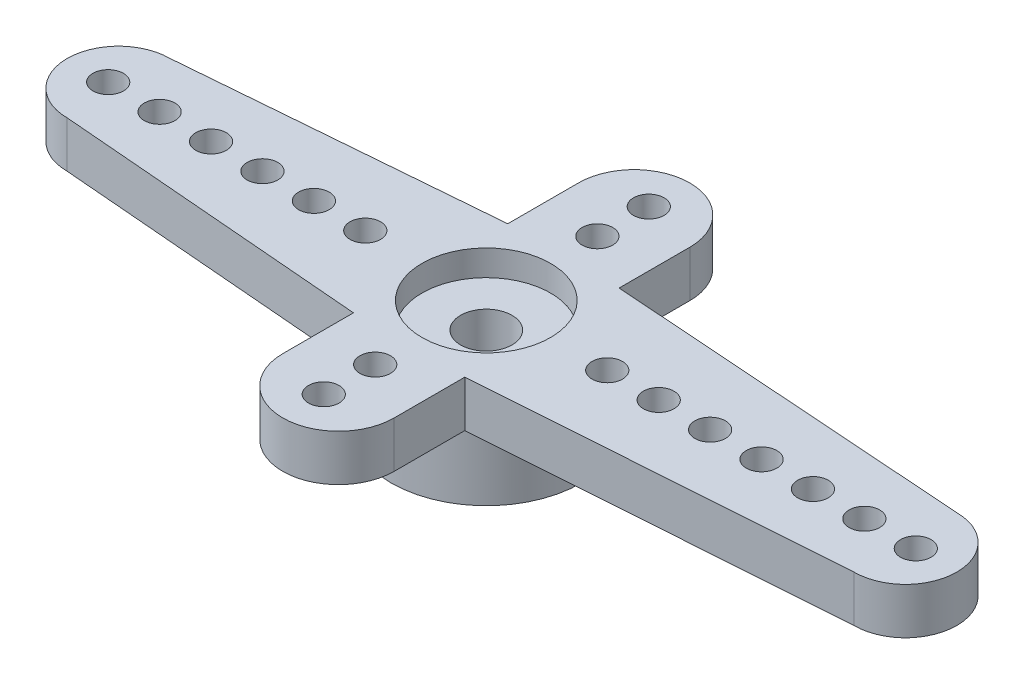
from build123d import *

# Parameters (mm, degrees)
CROQUIS1_R              = 3.7
SALIENTE_EXTRUIR2_DEPTH = 4.3
CROQUIS2_R              = 2.5
CORTAR_EXTRUIR1_DEPTH   = 1.5
CORTAR_EXTRUIR2_START   = -1
CROQUIS3_R              = 2.5
CORTAR_EXTRUIR2_DEPTH   = 1
CROQUIS4_R              = 1
CORTAR_EXTRUIR3_DEPTH   = 1.8
SALIENTE_EXTRUIR3_DEPTH = 1.8
CROQUIS6_R              = 0.595
CORTAR_EXTRUIR4_DEPTH   = 1.8
CROQUIS7_R              = 0.595
SALIENTE_EXTRUIR4_DEPTH = 1.8


with BuildPart() as part:
    # Croquis1 → Saliente-Extruir2 (new body)
    with BuildSketch(Plane(origin=(0, 0, 0), x_dir=(1, 0, 0), z_dir=(0, 1, 0))):
        with Locations(Location((0, 0, 0), (0, 0, 90))):
            Circle(CROQUIS1_R)
    extrude(amount=SALIENTE_EXTRUIR2_DEPTH)

    # Croquis2 → Cortar-Extruir1 (cut)
    with BuildSketch(Plane.XZ):
        with Locations(Location((0, 0, 0), (0, 0, 270))):
            Circle(CROQUIS2_R)
    extrude(amount=-CORTAR_EXTRUIR1_DEPTH, mode=Mode.SUBTRACT)

    # Croquis3 → Cortar-Extruir2 (cut)
    with BuildSketch(Plane(origin=(0, 4.3, 0), x_dir=(1, 0, 0), z_dir=(0, 1, 0)).offset(CORTAR_EXTRUIR2_START)):
        with Locations(Location((0, 0, 0), (0, 0, 90))):
            Circle(CROQUIS3_R)
    extrude(amount=CORTAR_EXTRUIR2_DEPTH, mode=Mode.SUBTRACT)

    # Croquis4 → Cortar-Extruir3 (cut)
    with BuildSketch(Plane(origin=(0, 3.3, 0), x_dir=(1, 0, 0), z_dir=(0, 1, 0))):
        with Locations(Location((0, 0, 0), (0, 0, 270))):
            Circle(CROQUIS4_R)
    extrude(amount=-CORTAR_EXTRUIR3_DEPTH, mode=Mode.SUBTRACT)

    # Croquis5 → Saliente-Extruir3 (add)
    with BuildSketch(Plane(origin=(0, 4.3, 0), x_dir=(1, 0, 0), z_dir=(0, 1, 0))):
        with BuildLine():
            Line((-2.16564, 3.000000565), (-3.120237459, 0))
            Line((-3.120237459, 0), (-2.16564, -3.000000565))
            Line((-2.16564, -3.000000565), (-14.3, -2))
            ThreePointArc((-14.3, -2), (-16.3, 0), (-14.3, 2))
            Line((-14.3, 2), (-2.16564, 3.000000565))
        make_face()
        with BuildLine():
            Line((3.120237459, 0), (2.16564, -3.000000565))
            Line((2.16564, -3.000000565), (16.3, -2))
            ThreePointArc((16.3, -2), (18.3, 0), (16.3, 2))
            Line((16.3, 2), (2.16564, 3.000000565))
            Line((2.16564, 3.000000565), (3.120237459, 0))
        make_face()
    extrude(amount=-SALIENTE_EXTRUIR3_DEPTH)

    # Croquis6 → Cortar-Extruir4 (cut)
    with BuildSketch(Plane(origin=(0, 4.3, 0), x_dir=(1, 0, 0), z_dir=(0, 1, 0))):
        with Locations(Location((-14.705, 0, 0), (0, 0, 270))):
            Circle(CROQUIS6_R)
        with Locations(Location((-12.705, 0, 0), (0, 0, 270))):
            Circle(CROQUIS6_R)
        with Locations(Location((-10.705, 0, 0), (0, 0, 270))):
            Circle(CROQUIS6_R)
        with Locations(Location((-8.705, 0, 0), (0, 0, 270))):
            Circle(CROQUIS6_R)
        with Locations(Location((-6.705, 0, 0), (0, 0, 270))):
            Circle(CROQUIS6_R)
        with Locations(Location((-4.705, 0, 0), (0, 0, 270))):
            Circle(CROQUIS6_R)
        with Locations(Location((14.705, 0, 0), (0, 0, 90))):
            Circle(CROQUIS6_R)
        with Locations(Location((12.705, 0, 0), (0, 0, 90))):
            Circle(CROQUIS6_R)
        with Locations(Location((10.705, 0, 0), (0, 0, 90))):
            Circle(CROQUIS6_R)
        with Locations(Location((8.705, 0, 0), (0, 0, 90))):
            Circle(CROQUIS6_R)
        with Locations(Location((6.705, 0, 0), (0, 0, 90))):
            Circle(CROQUIS6_R)
        with Locations(Location((4.705, 0, 0), (0, 0, 90))):
            Circle(CROQUIS6_R)
        with Locations(Location((16.705, 0, 0), (0, 0, 90))):
            Circle(CROQUIS6_R)
    extrude(amount=-CORTAR_EXTRUIR4_DEPTH, mode=Mode.SUBTRACT)

    # Croquis7 → Saliente-Extruir4 (add)
    # profile 1 of 2: a face of its own
    with BuildSketch(Plane(origin=(0, 4.3, 0), x_dir=(1, 0, 0), z_dir=(0, 1, 0))):
        with BuildLine():
            Line((-2.16564, 3.000000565), (2.16564, 3.000000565))
            Line((2.16564, 3.000000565), (2.16564, 5.750000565))
            ThreePointArc((2.16564, 5.750000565), (0, 7.915640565), (-2.16564, 5.750000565))
            Line((-2.16564, 5.750000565), (-2.16564, 3.000000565))
        make_face()
        with Locations(Location((0, 6.320640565, 0), (0, 0, 270))):
            Circle(CROQUIS7_R, mode=Mode.SUBTRACT)
        with Locations(Location((0, 4.320640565, 0), (0, 0, 270))):
            Circle(CROQUIS7_R, mode=Mode.SUBTRACT)
    # profile 2 of 2: a face of its own
    with BuildSketch(Plane(origin=(0, 4.3, 0), x_dir=(1, 0, 0), z_dir=(0, 1, 0))):
        with BuildLine():
            Line((2.16564, -3.000000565), (2.16564, -5.750000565))
            ThreePointArc((2.16564, -5.750000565), (0, -7.915640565), (-2.16564, -5.750000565))
            Line((-2.16564, -5.750000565), (-2.16564, -3.000000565))
            Line((-2.16564, -3.000000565), (2.16564, -3.000000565))
        make_face()
        with Locations(Location((0, -4.320640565, 0), (0, 0, 90))):
            Circle(CROQUIS7_R, mode=Mode.SUBTRACT)
        with Locations(Location((0, -6.320640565, 0), (0, 0, 90))):
            Circle(CROQUIS7_R, mode=Mode.SUBTRACT)
    extrude(amount=-SALIENTE_EXTRUIR4_DEPTH)


solid = part.part
